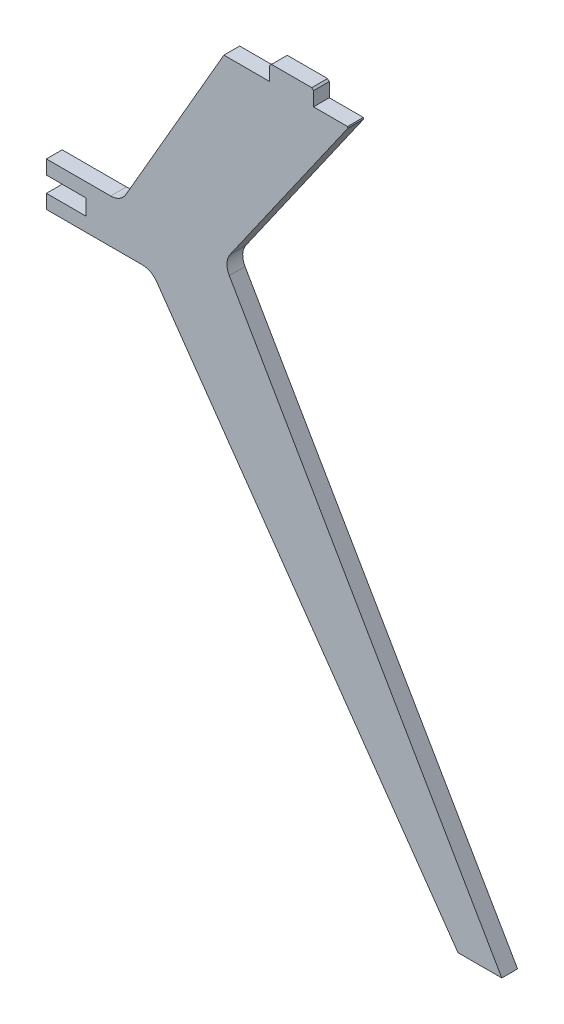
from build123d import *
from OCP.BRepFilletAPI import BRepFilletAPI_MakeChamfer

# Parameters (mm, degrees)
SALIENTE_EXTRUIR1_DEPTH = 18
CROQUIS2_W              = 50
CROQUIS2_H              = 18
SALIENTE_EXTRUIR2_DEPTH = 18
CHAFL_N1_SIZE           = 2
CHAFL_N1_SIZE2          = 1.436030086
REDONDEO1_R             = 20


with BuildPart() as part:
    # Croquis1 → Saliente-Extruir1 (new body)
    with BuildSketch(Plane.XY):
        Polygon((0, 0), (-317.542648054, 550), (-174.70031026, 754), (-317.334691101, 754), (-435.114146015, 550), (-520, 550), (-520, 534), (-475, 534), (-475, 516), (-520, 516), (-520, 500), (-400.103769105, 500), (-50, 0), align=None)
    extrude(amount=SALIENTE_EXTRUIR1_DEPTH)

    # Croquis2 → Saliente-Extruir2 (add)
    with BuildSketch(Plane(origin=(0, 754, 0), x_dir=(1, 0, 0), z_dir=(0, 1, 0))):
        with Locations((-240, -9)):
            Rectangle(CROQUIS2_W, CROQUIS2_H)
    extrude(amount=SALIENTE_EXTRUIR2_DEPTH)

    # Chafl_n1: one chamfer whose edges measure the first distance from different faces: ONE call of the kernel's chamfer builder (chamfer() names one face for all edges)
    chafl_n1_edges_1 = [part.edges().sort_by_distance(p)[0] for p in [
        (-174.70031026, 754, 9),
    ]]
    chafl_n1_side_1 = [part.faces().sort_by_distance(p)[0] for p in [
        (-246.121479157, 652, 9),
    ]]
    chafl_n1_edges_2 = [part.edges().sort_by_distance(p)[0] for p in [
        (-265, 772, 9),
        (-215, 772, 9),
    ]]
    chafl_n1 = BRepFilletAPI_MakeChamfer(part.part.solid().wrapped)
    for e in chafl_n1_edges_1:
        chafl_n1.Add(CHAFL_N1_SIZE, CHAFL_N1_SIZE2, e.wrapped, chafl_n1_side_1[0].wrapped)  # the first distance lies on this face
    for e in chafl_n1_edges_2:
        chafl_n1.Add(CHAFL_N1_SIZE, e.wrapped)
    add(Compound.cast(chafl_n1.Shape()), mode=Mode.REPLACE)

    # Redondeo1
    redondeo1_edges = [part.edges().sort_by_distance(p)[0] for p in [
        (-400.103769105, 500, 9),
        (-435.114146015, 550, 9),
        (-317.542648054, 550, 9),
    ]]
    fillet(redondeo1_edges, radius=REDONDEO1_R)


solid = part.part
